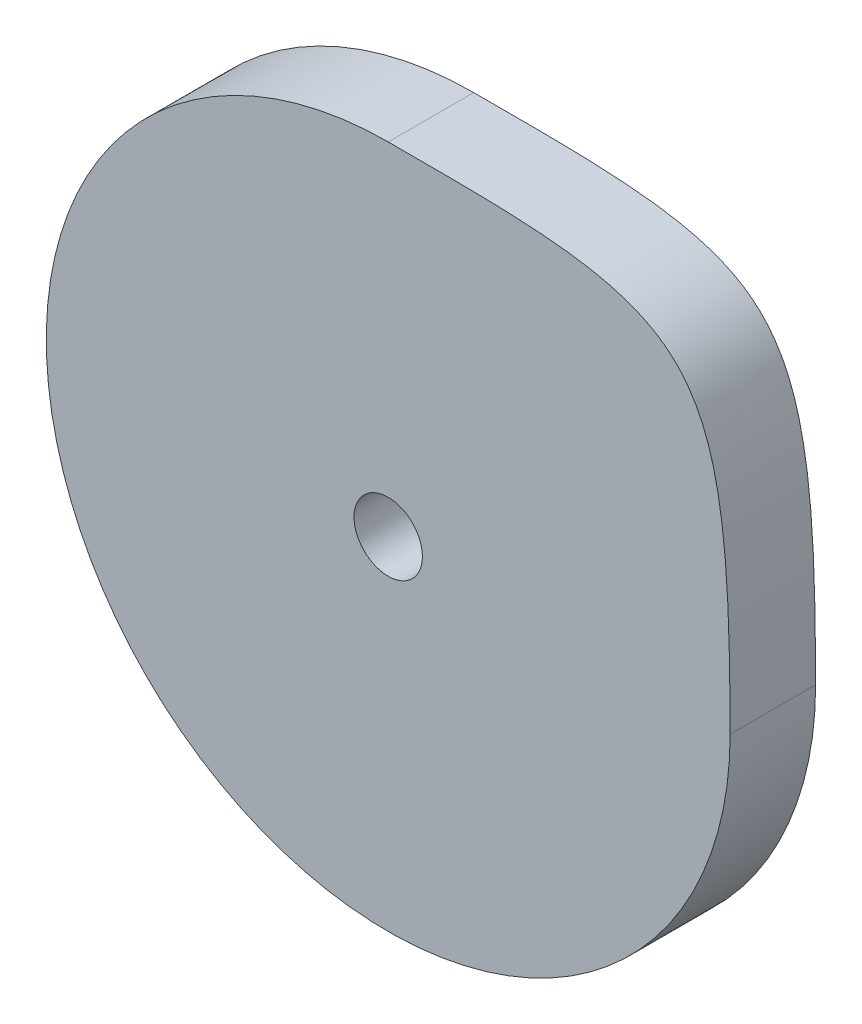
from build123d import *

# Parameters (mm, degrees)
SKETCH1_R           = 4
BOSS_EXTRUDE1_DEPTH = 10


with BuildPart() as part:
    # Sketch1 → Boss-Extrude1 (new body)
    with BuildSketch(Plane.XY):
        with BuildLine():
            ThreePointArc((0, 40), (-28.284271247, -28.284271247), (40, 0))
            add(Edge.make_bspline(
                [(0, 40), (14.14864971, 40), (37.3343438, 40.259845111), (40, 22.29185809), (40, 0)],
                knots=[0, 0, 0, 0, 0.453024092, 1, 1, 1, 1], degree=3))
        make_face()
        Circle(SKETCH1_R, mode=Mode.SUBTRACT)
    extrude(amount=BOSS_EXTRUDE1_DEPTH)


solid = part.part
